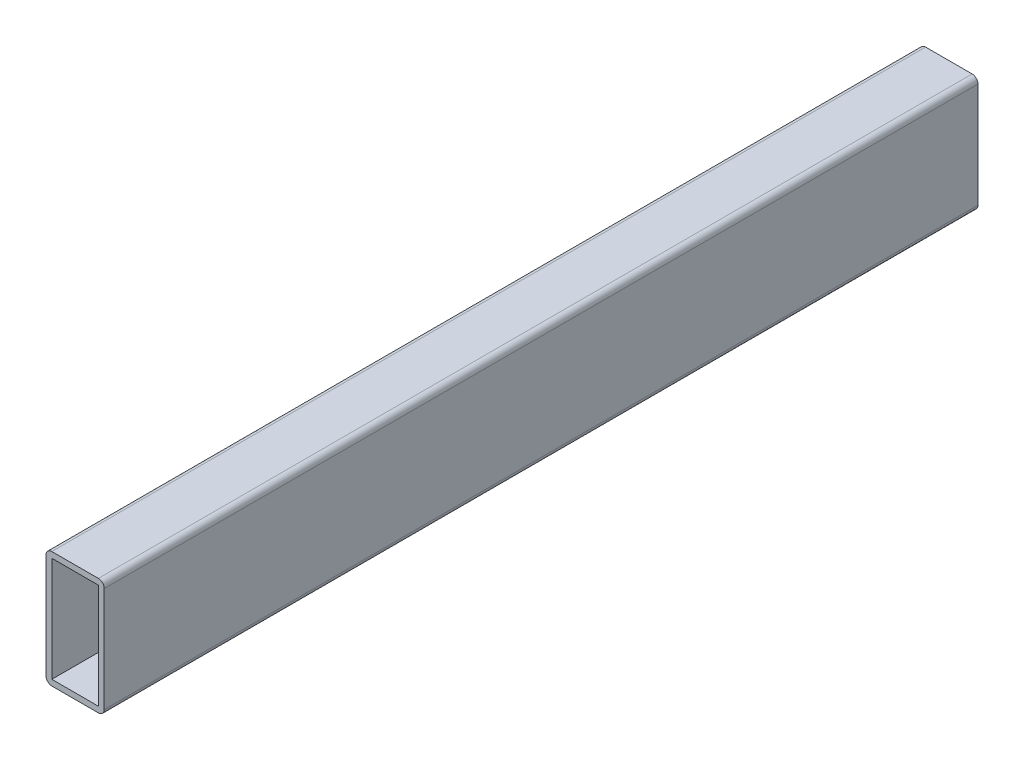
from build123d import *

# Parameters (mm, degrees)
SKETCH_1_W      = 16
SKETCH_1_H      = 36
EXTRUDE_1_DEPTH = 300


with BuildPart() as part:
    # Sketch 1 → Extrude 1 (new body)
    with BuildSketch(Plane.XY):
        with BuildLine():
            Line((-2, 0), (-18, 0))
            ThreePointArc((-18, 0), (-19.414213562, -0.585786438), (-20, -2))
            Line((-20, -2), (-20, -38))
            ThreePointArc((-20, -38), (-19.414213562, -39.414213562), (-18, -40))
            Line((-18, -40), (-2, -40))
            ThreePointArc((-2, -40), (-0.585786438, -39.414213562), (0, -38))
            Line((0, -38), (0, -2))
            ThreePointArc((0, -2), (-0.585786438, -0.585786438), (-2, 0))
        make_face()
        with Locations((-10, -20)):
            Rectangle(SKETCH_1_W, SKETCH_1_H, mode=Mode.SUBTRACT)
    extrude(amount=EXTRUDE_1_DEPTH)


solid = part.part
